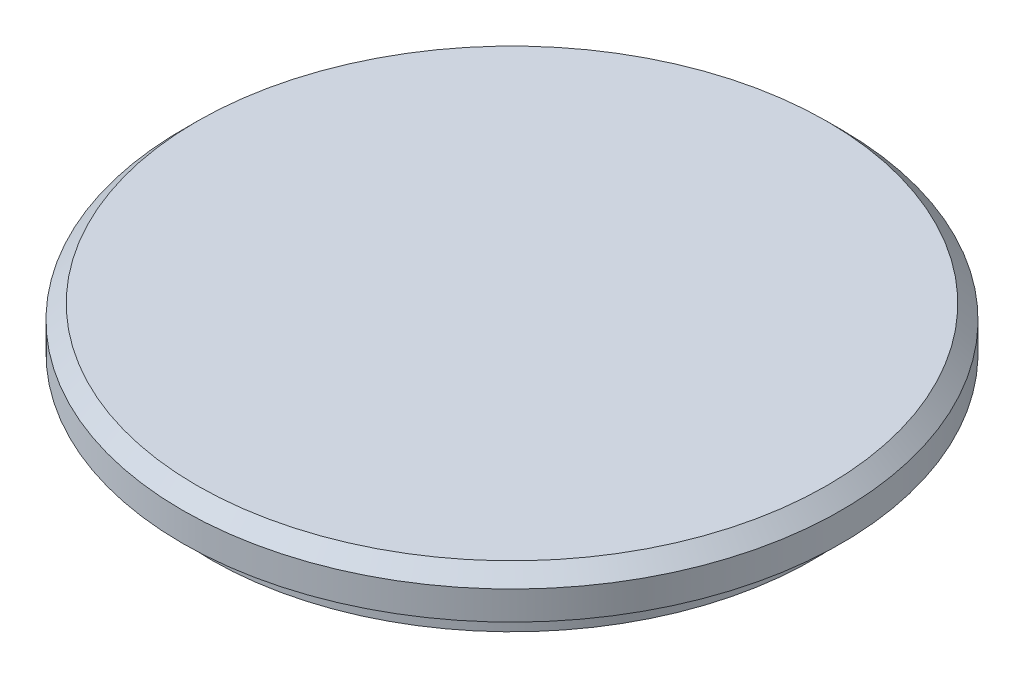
ISO-10303-21;
HEADER;
FILE_DESCRIPTION(('STEP AP214'),'2;1');
FILE_NAME('part.step','',(''),(''),'','','');
FILE_SCHEMA(('AUTOMOTIVE_DESIGN { 1 0 10303 214 1 1 1 1 }'));
ENDSEC;
DATA;
#1=APPLICATION_CONTEXT('core data for automotive mechanical design processes');
#2=APPLICATION_PROTOCOL_DEFINITION('international standard','automotive_design',2000,#1);
#3=PRODUCT_CONTEXT('',#1,'mechanical');
#4=PRODUCT('Part','Part','',(#3));
#5=PRODUCT_RELATED_PRODUCT_CATEGORY('part','',(#4));
#6=PRODUCT_DEFINITION_FORMATION('','',#4);
#7=PRODUCT_DEFINITION_CONTEXT('part definition',#1,'design');
#8=PRODUCT_DEFINITION('design','',#6,#7);
#9=PRODUCT_DEFINITION_SHAPE('','',#8);
#10=(LENGTH_UNIT() NAMED_UNIT(*) SI_UNIT(.MILLI.,.METRE.));
#11=(NAMED_UNIT(*) PLANE_ANGLE_UNIT() SI_UNIT($,.RADIAN.));
#12=(NAMED_UNIT(*) SI_UNIT($,.STERADIAN.) SOLID_ANGLE_UNIT());
#13=UNCERTAINTY_MEASURE_WITH_UNIT(LENGTH_MEASURE(1.E-05),#10,'distance_accuracy_value','');
#14=(GEOMETRIC_REPRESENTATION_CONTEXT(3) GLOBAL_UNCERTAINTY_ASSIGNED_CONTEXT((#13)) GLOBAL_UNIT_ASSIGNED_CONTEXT((#10,
#11,#12)) REPRESENTATION_CONTEXT('',''));
#15=CARTESIAN_POINT('',(0.,0.,0.));
#16=DIRECTION('',(0.,0.,1.));
#17=DIRECTION('',(1.,0.,0.));
#18=AXIS2_PLACEMENT_3D('',#15,#16,#17);
#19=CARTESIAN_POINT('',(18.5,10.,0.));
#20=DIRECTION('',(0.,1.,0.));
#21=DIRECTION('',(0.,0.,1.));
#22=AXIS2_PLACEMENT_3D('',#19,#20,#21);
#23=PLANE('',#22);
#24=CARTESIAN_POINT('',(0.,10.,0.));
#25=DIRECTION('',(0.,1.,0.));
#26=DIRECTION('',(0.,0.,1.));
#27=AXIS2_PLACEMENT_3D('',#24,#25,#26);
#28=CIRCLE('',#27,18.5);
#29=CARTESIAN_POINT('',(0.,10.,18.5));
#30=VERTEX_POINT('',#29);
#31=EDGE_CURVE('E10',#30,#30,#28,.T.);
#32=ORIENTED_EDGE('',*,*,#31,.F.);
#33=EDGE_LOOP('',(#32));
#34=FACE_BOUND('',#33,.T.);
#35=ADVANCED_FACE('F30',(#34),#23,.F.);
#36=CARTESIAN_POINT('',(0.,9.50000000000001,0.));
#37=DIRECTION('',(0.,1.,0.));
#38=DIRECTION('',(0.,0.,1.));
#39=AXIS2_PLACEMENT_3D('',#36,#37,#38);
#40=TOROIDAL_SURFACE('',#39,18.5,0.5);
#41=CARTESIAN_POINT('',(0.,9.5,0.));
#42=DIRECTION('',(0.,1.,0.));
#43=DIRECTION('',(0.,0.,1.));
#44=AXIS2_PLACEMENT_3D('',#41,#42,#43);
#45=CIRCLE('',#44,19.);
#46=CARTESIAN_POINT('',(0.,9.5,19.));
#47=VERTEX_POINT('',#46);
#48=EDGE_CURVE('E36',#47,#47,#45,.T.);
#49=ORIENTED_EDGE('',*,*,#48,.F.);
#50=EDGE_LOOP('',(#49));
#51=FACE_BOUND('',#50,.T.);
#52=ORIENTED_EDGE('',*,*,#31,.T.);
#53=EDGE_LOOP('',(#52));
#54=FACE_BOUND('',#53,.T.);
#55=ADVANCED_FACE('F96',(#51,#54),#40,.F.);
#56=CARTESIAN_POINT('',(0.,60.,0.));
#57=DIRECTION('',(0.,1.,0.));
#58=DIRECTION('',(0.,0.,1.));
#59=AXIS2_PLACEMENT_3D('',#56,#57,#58);
#60=CYLINDRICAL_SURFACE('',#59,19.);
#61=CARTESIAN_POINT('',(0.,7.00000000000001,0.));
#62=DIRECTION('',(0.,1.,0.));
#63=DIRECTION('',(0.,0.,1.));
#64=AXIS2_PLACEMENT_3D('',#61,#62,#63);
#65=CIRCLE('',#64,19.);
#66=CARTESIAN_POINT('',(0.,7.00000000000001,19.));
#67=VERTEX_POINT('',#66);
#68=EDGE_CURVE('E40',#67,#67,#65,.T.);
#69=ORIENTED_EDGE('',*,*,#68,.F.);
#70=EDGE_LOOP('',(#69));
#71=FACE_BOUND('',#70,.T.);
#72=ORIENTED_EDGE('',*,*,#48,.T.);
#73=EDGE_LOOP('',(#72));
#74=FACE_BOUND('',#73,.T.);
#75=ADVANCED_FACE('F91',(#71,#74),#60,.F.);
#76=CARTESIAN_POINT('',(21.,7.00000000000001,0.));
#77=DIRECTION('',(0.,1.,0.));
#78=DIRECTION('',(0.,0.,1.));
#79=AXIS2_PLACEMENT_3D('',#76,#77,#78);
#80=PLANE('',#79);
#81=CARTESIAN_POINT('',(0.,7.00000000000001,0.));
#82=DIRECTION('',(0.,1.,0.));
#83=DIRECTION('',(0.,0.,1.));
#84=AXIS2_PLACEMENT_3D('',#81,#82,#83);
#85=CIRCLE('',#84,21.);
#86=CARTESIAN_POINT('',(0.,7.00000000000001,21.));
#87=VERTEX_POINT('',#86);
#88=EDGE_CURVE('E44',#87,#87,#85,.T.);
#89=ORIENTED_EDGE('',*,*,#88,.F.);
#90=EDGE_LOOP('',(#89));
#91=FACE_BOUND('',#90,.T.);
#92=ORIENTED_EDGE('',*,*,#68,.T.);
#93=EDGE_LOOP('',(#92));
#94=FACE_BOUND('',#93,.T.);
#95=ADVANCED_FACE('F85',(#91,#94),#80,.F.);
#96=CARTESIAN_POINT('',(0.,60.,0.));
#97=DIRECTION('',(0.,1.,0.));
#98=DIRECTION('',(0.,0.,1.));
#99=AXIS2_PLACEMENT_3D('',#96,#97,#98);
#100=CYLINDRICAL_SURFACE('',#99,21.);
#101=CARTESIAN_POINT('',(0.,9.00000000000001,0.));
#102=DIRECTION('',(0.,1.,0.));
#103=DIRECTION('',(0.,0.,1.));
#104=AXIS2_PLACEMENT_3D('',#101,#102,#103);
#105=CIRCLE('',#104,21.);
#106=CARTESIAN_POINT('',(0.,9.00000000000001,21.));
#107=VERTEX_POINT('',#106);
#108=EDGE_CURVE('E49',#107,#107,#105,.T.);
#109=ORIENTED_EDGE('',*,*,#108,.F.);
#110=EDGE_LOOP('',(#109));
#111=FACE_BOUND('',#110,.T.);
#112=ORIENTED_EDGE('',*,*,#88,.T.);
#113=EDGE_LOOP('',(#112));
#114=FACE_BOUND('',#113,.T.);
#115=ADVANCED_FACE('F79',(#111,#114),#100,.T.);
#116=CARTESIAN_POINT('',(23.,9.00000000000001,0.));
#117=DIRECTION('',(0.,1.,0.));
#118=DIRECTION('',(0.,0.,1.));
#119=AXIS2_PLACEMENT_3D('',#116,#117,#118);
#120=PLANE('',#119);
#121=CARTESIAN_POINT('',(0.,9.00000000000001,0.));
#122=DIRECTION('',(0.,1.,0.));
#123=DIRECTION('',(0.,0.,1.));
#124=AXIS2_PLACEMENT_3D('',#121,#122,#123);
#125=CIRCLE('',#124,23.);
#126=CARTESIAN_POINT('',(0.,9.00000000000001,23.));
#127=VERTEX_POINT('',#126);
#128=EDGE_CURVE('E52',#127,#127,#125,.T.);
#129=ORIENTED_EDGE('',*,*,#128,.F.);
#130=EDGE_LOOP('',(#129));
#131=FACE_BOUND('',#130,.T.);
#132=ORIENTED_EDGE('',*,*,#108,.T.);
#133=EDGE_LOOP('',(#132));
#134=FACE_BOUND('',#133,.T.);
#135=ADVANCED_FACE('F73',(#131,#134),#120,.F.);
#136=CARTESIAN_POINT('',(0.,60.,0.));
#137=DIRECTION('',(0.,1.,0.));
#138=DIRECTION('',(0.,0.,1.));
#139=AXIS2_PLACEMENT_3D('',#136,#137,#138);
#140=CYLINDRICAL_SURFACE('',#139,23.);
#141=CARTESIAN_POINT('',(0.,11.,0.));
#142=DIRECTION('',(0.,1.,0.));
#143=DIRECTION('',(0.,0.,1.));
#144=AXIS2_PLACEMENT_3D('',#141,#142,#143);
#145=CIRCLE('',#144,23.);
#146=CARTESIAN_POINT('',(0.,11.,23.));
#147=VERTEX_POINT('',#146);
#148=EDGE_CURVE('E55',#147,#147,#145,.T.);
#149=ORIENTED_EDGE('',*,*,#148,.F.);
#150=EDGE_LOOP('',(#149));
#151=FACE_BOUND('',#150,.T.);
#152=ORIENTED_EDGE('',*,*,#128,.T.);
#153=EDGE_LOOP('',(#152));
#154=FACE_BOUND('',#153,.T.);
#155=ADVANCED_FACE('F67',(#151,#154),#140,.T.);
#156=CARTESIAN_POINT('',(0.,11.,0.));
#157=DIRECTION('',(0.,-1.,0.));
#158=DIRECTION('',(0.,0.,-1.));
#159=AXIS2_PLACEMENT_3D('',#156,#157,#158);
#160=CONICAL_SURFACE('',#159,23.,0.785398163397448);
#161=CARTESIAN_POINT('',(0.,12.,0.));
#162=DIRECTION('',(0.,1.,0.));
#163=DIRECTION('',(0.,0.,1.));
#164=AXIS2_PLACEMENT_3D('',#161,#162,#163);
#165=CIRCLE('',#164,22.);
#166=CARTESIAN_POINT('',(0.,12.,22.));
#167=VERTEX_POINT('',#166);
#168=EDGE_CURVE('E58',#167,#167,#165,.T.);
#169=ORIENTED_EDGE('',*,*,#168,.F.);
#170=EDGE_LOOP('',(#169));
#171=FACE_BOUND('',#170,.T.);
#172=ORIENTED_EDGE('',*,*,#148,.T.);
#173=EDGE_LOOP('',(#172));
#174=FACE_BOUND('',#173,.T.);
#175=ADVANCED_FACE('F64',(#171,#174),#160,.T.);
#176=CARTESIAN_POINT('',(0.,12.,0.));
#177=DIRECTION('',(0.,-1.,0.));
#178=DIRECTION('',(0.,0.,-1.));
#179=AXIS2_PLACEMENT_3D('',#176,#177,#178);
#180=PLANE('',#179);
#181=ORIENTED_EDGE('',*,*,#168,.T.);
#182=EDGE_LOOP('',(#181));
#183=FACE_BOUND('',#182,.T.);
#184=ADVANCED_FACE('F62',(#183),#180,.F.);
#185=CLOSED_SHELL('',(#35,#55,#75,#95,#115,#135,#155,#175,#184));
#186=MANIFOLD_SOLID_BREP('B2',#185);
#187=ADVANCED_BREP_SHAPE_REPRESENTATION('',(#18,#186),#14);
#188=SHAPE_DEFINITION_REPRESENTATION(#9,#187);
ENDSEC;
END-ISO-10303-21;
